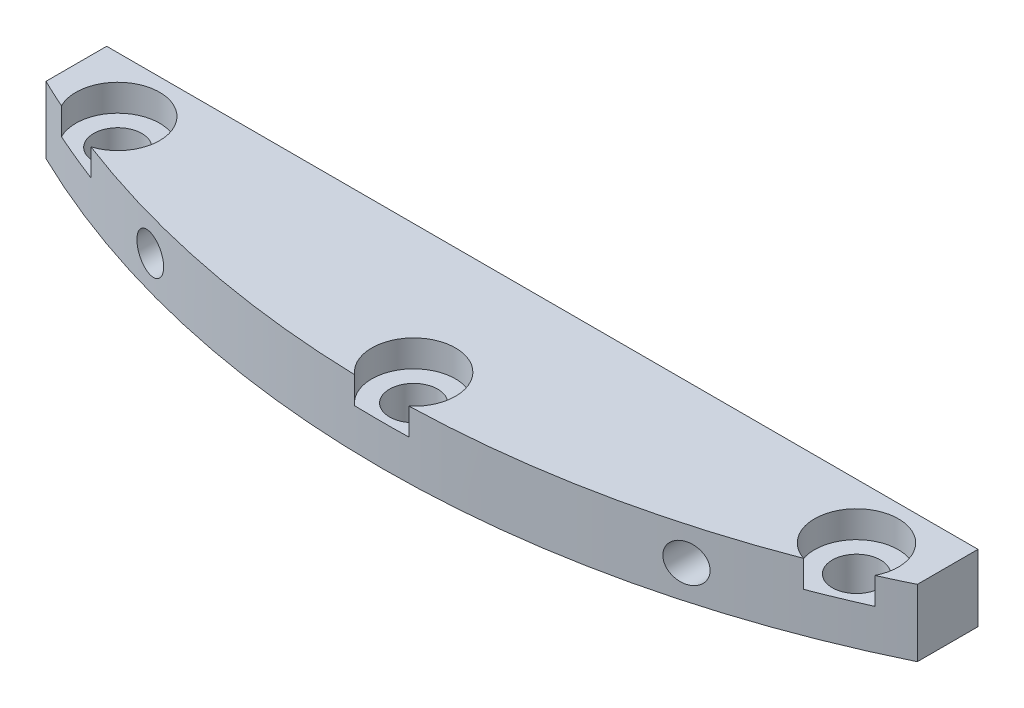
ISO-10303-21;
HEADER;
FILE_DESCRIPTION(('STEP AP214'),'2;1');
FILE_NAME('part.step','',(''),(''),'','','');
FILE_SCHEMA(('AUTOMOTIVE_DESIGN { 1 0 10303 214 1 1 1 1 }'));
ENDSEC;
DATA;
#1=APPLICATION_CONTEXT('core data for automotive mechanical design processes');
#2=APPLICATION_PROTOCOL_DEFINITION('international standard','automotive_design',2000,#1);
#3=PRODUCT_CONTEXT('',#1,'mechanical');
#4=PRODUCT('Part','Part','',(#3));
#5=PRODUCT_RELATED_PRODUCT_CATEGORY('part','',(#4));
#6=PRODUCT_DEFINITION_FORMATION('','',#4);
#7=PRODUCT_DEFINITION_CONTEXT('part definition',#1,'design');
#8=PRODUCT_DEFINITION('design','',#6,#7);
#9=PRODUCT_DEFINITION_SHAPE('','',#8);
#10=(LENGTH_UNIT() NAMED_UNIT(*) SI_UNIT(.MILLI.,.METRE.));
#11=(NAMED_UNIT(*) PLANE_ANGLE_UNIT() SI_UNIT($,.RADIAN.));
#12=(NAMED_UNIT(*) SI_UNIT($,.STERADIAN.) SOLID_ANGLE_UNIT());
#13=UNCERTAINTY_MEASURE_WITH_UNIT(LENGTH_MEASURE(1.E-05),#10,'distance_accuracy_value','');
#14=(GEOMETRIC_REPRESENTATION_CONTEXT(3) GLOBAL_UNCERTAINTY_ASSIGNED_CONTEXT((#13)) GLOBAL_UNIT_ASSIGNED_CONTEXT((#10,
#11,#12)) REPRESENTATION_CONTEXT('',''));
#15=CARTESIAN_POINT('',(0.,0.,0.));
#16=DIRECTION('',(0.,0.,1.));
#17=DIRECTION('',(1.,0.,0.));
#18=AXIS2_PLACEMENT_3D('',#15,#16,#17);
#19=CARTESIAN_POINT('',(-34.9925730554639,6.35,84.479544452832));
#20=DIRECTION('',(0.,-1.,0.));
#21=DIRECTION('',(0.,0.,-1.));
#22=AXIS2_PLACEMENT_3D('',#19,#20,#21);
#23=CYLINDRICAL_SURFACE('',#22,2.286);
#24=CARTESIAN_POINT('',(-34.9925730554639,0.,84.479544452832));
#25=DIRECTION('',(0.,1.,0.));
#26=DIRECTION('',(0.,0.,1.));
#27=AXIS2_PLACEMENT_3D('',#24,#25,#26);
#28=CIRCLE('',#27,2.286);
#29=CARTESIAN_POINT('',(-34.9925730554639,0.,86.765544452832));
#30=VERTEX_POINT('',#29);
#31=EDGE_CURVE('E282',#30,#30,#28,.T.);
#32=ORIENTED_EDGE('',*,*,#31,.F.);
#33=EDGE_LOOP('',(#32));
#34=FACE_BOUND('',#33,.T.);
#35=CARTESIAN_POINT('',(-34.9925730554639,3.81,84.479544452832));
#36=DIRECTION('',(0.,1.,0.));
#37=DIRECTION('',(0.,0.,1.));
#38=AXIS2_PLACEMENT_3D('',#35,#36,#37);
#39=CIRCLE('',#38,2.286);
#40=CARTESIAN_POINT('',(-34.9925730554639,3.81,86.765544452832));
#41=VERTEX_POINT('',#40);
#42=EDGE_CURVE('E307',#41,#41,#39,.T.);
#43=ORIENTED_EDGE('',*,*,#42,.T.);
#44=EDGE_LOOP('',(#43));
#45=FACE_BOUND('',#44,.T.);
#46=ADVANCED_FACE('F89',(#34,#45),#23,.F.);
#47=CARTESIAN_POINT('',(0.,6.35,91.440000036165));
#48=DIRECTION('',(0.,-1.,0.));
#49=DIRECTION('',(0.,0.,-1.));
#50=AXIS2_PLACEMENT_3D('',#47,#48,#49);
#51=CYLINDRICAL_SURFACE('',#50,2.286);
#52=CARTESIAN_POINT('',(0.,0.,91.440000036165));
#53=DIRECTION('',(0.,1.,0.));
#54=DIRECTION('',(0.,0.,1.));
#55=AXIS2_PLACEMENT_3D('',#52,#53,#54);
#56=CIRCLE('',#55,2.286);
#57=CARTESIAN_POINT('',(0.,0.,93.726000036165));
#58=VERTEX_POINT('',#57);
#59=EDGE_CURVE('E224',#58,#58,#56,.T.);
#60=ORIENTED_EDGE('',*,*,#59,.F.);
#61=EDGE_LOOP('',(#60));
#62=FACE_BOUND('',#61,.T.);
#63=CARTESIAN_POINT('',(0.,3.81,91.440000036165));
#64=DIRECTION('',(0.,1.,0.));
#65=DIRECTION('',(0.,0.,1.));
#66=AXIS2_PLACEMENT_3D('',#63,#64,#65);
#67=CIRCLE('',#66,2.286);
#68=CARTESIAN_POINT('',(0.,3.81,93.726000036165));
#69=VERTEX_POINT('',#68);
#70=EDGE_CURVE('E302',#69,#69,#67,.T.);
#71=ORIENTED_EDGE('',*,*,#70,.T.);
#72=EDGE_LOOP('',(#71));
#73=FACE_BOUND('',#72,.T.);
#74=ADVANCED_FACE('F242',(#62,#73),#51,.F.);
#75=CARTESIAN_POINT('',(34.9925730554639,6.35,84.479544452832));
#76=DIRECTION('',(0.,-1.,0.));
#77=DIRECTION('',(0.,0.,-1.));
#78=AXIS2_PLACEMENT_3D('',#75,#76,#77);
#79=CYLINDRICAL_SURFACE('',#78,2.286);
#80=CARTESIAN_POINT('',(34.9925730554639,0.,84.479544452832));
#81=DIRECTION('',(0.,1.,0.));
#82=DIRECTION('',(0.,0.,-1.));
#83=AXIS2_PLACEMENT_3D('',#80,#81,#82);
#84=CIRCLE('',#83,2.286);
#85=CARTESIAN_POINT('',(34.9925730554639,0.,82.193544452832));
#86=VERTEX_POINT('',#85);
#87=EDGE_CURVE('E198',#86,#86,#84,.T.);
#88=ORIENTED_EDGE('',*,*,#87,.F.);
#89=EDGE_LOOP('',(#88));
#90=FACE_BOUND('',#89,.T.);
#91=CARTESIAN_POINT('',(34.9925730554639,3.81,84.479544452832));
#92=DIRECTION('',(0.,1.,0.));
#93=DIRECTION('',(0.,0.,1.));
#94=AXIS2_PLACEMENT_3D('',#91,#92,#93);
#95=CIRCLE('',#94,2.286);
#96=CARTESIAN_POINT('',(34.9925730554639,3.81,86.765544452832));
#97=VERTEX_POINT('',#96);
#98=EDGE_CURVE('E294',#97,#97,#95,.T.);
#99=ORIENTED_EDGE('',*,*,#98,.T.);
#100=EDGE_LOOP('',(#99));
#101=FACE_BOUND('',#100,.T.);
#102=ADVANCED_FACE('F245',(#90,#101),#79,.F.);
#103=CARTESIAN_POINT('',(0.,6.35,0.));
#104=DIRECTION('',(0.,1.,0.));
#105=DIRECTION('',(0.,0.,1.));
#106=AXIS2_PLACEMENT_3D('',#103,#104,#105);
#107=PLANE('',#106);
#108=CARTESIAN_POINT('',(-34.9925730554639,6.35,84.479544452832));
#109=DIRECTION('',(0.,1.,0.));
#110=DIRECTION('',(0.,0.,1.));
#111=AXIS2_PLACEMENT_3D('',#108,#109,#110);
#112=CIRCLE('',#111,3.96875);
#113=CARTESIAN_POINT('',(-33.7585751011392,6.35,88.2515764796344));
#114=VERTEX_POINT('',#113);
#115=CARTESIAN_POINT('',(-38.532370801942,6.35,86.2742055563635));
#116=VERTEX_POINT('',#115);
#117=EDGE_CURVE('E167',#114,#116,#112,.T.);
#118=ORIENTED_EDGE('',*,*,#117,.F.);
#119=CARTESIAN_POINT('',(0.,6.35,0.));
#120=DIRECTION('',(0.,1.,0.));
#121=DIRECTION('',(0.,0.,1.));
#122=AXIS2_PLACEMENT_3D('',#119,#120,#121);
#123=CIRCLE('',#122,94.488);
#124=CARTESIAN_POINT('',(-2.5835596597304,6.35,94.4526726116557));
#125=VERTEX_POINT('',#124);
#126=EDGE_CURVE('E176',#114,#125,#123,.T.);
#127=ORIENTED_EDGE('',*,*,#126,.T.);
#128=CARTESIAN_POINT('',(0.,6.35,91.440000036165));
#129=DIRECTION('',(0.,1.,0.));
#130=DIRECTION('',(0.,0.,1.));
#131=AXIS2_PLACEMENT_3D('',#128,#129,#130);
#132=CIRCLE('',#131,3.96875);
#133=CARTESIAN_POINT('',(2.58355965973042,6.35,94.4526726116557));
#134=VERTEX_POINT('',#133);
#135=EDGE_CURVE('E303',#134,#125,#132,.T.);
#136=ORIENTED_EDGE('',*,*,#135,.F.);
#137=CARTESIAN_POINT('',(33.7585751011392,6.35,88.2515764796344));
#138=VERTEX_POINT('',#137);
#139=EDGE_CURVE('E184',#134,#138,#123,.T.);
#140=ORIENTED_EDGE('',*,*,#139,.T.);
#141=CARTESIAN_POINT('',(34.9925730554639,6.35,84.479544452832));
#142=DIRECTION('',(0.,1.,0.));
#143=DIRECTION('',(0.,0.,1.));
#144=AXIS2_PLACEMENT_3D('',#141,#142,#143);
#145=CIRCLE('',#144,3.96875);
#146=CARTESIAN_POINT('',(38.532370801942,6.35,86.2742055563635));
#147=VERTEX_POINT('',#146);
#148=EDGE_CURVE('E295',#147,#138,#145,.T.);
#149=ORIENTED_EDGE('',*,*,#148,.F.);
#150=CARTESIAN_POINT('',(41.275,6.35,84.9962147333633));
#151=VERTEX_POINT('',#150);
#152=EDGE_CURVE('E187',#147,#151,#123,.T.);
#153=ORIENTED_EDGE('',*,*,#152,.T.);
#154=DIRECTION('',(0.,0.,-1.));
#155=VECTOR('',#154,1.);
#156=CARTESIAN_POINT('',(41.275,6.35,79.248000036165));
#157=LINE('',#156,#155);
#158=CARTESIAN_POINT('',(41.275,6.35,79.248000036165));
#159=VERTEX_POINT('',#158);
#160=EDGE_CURVE('E186',#151,#159,#157,.T.);
#161=ORIENTED_EDGE('',*,*,#160,.T.);
#162=DIRECTION('',(-1.,0.,0.));
#163=VECTOR('',#162,1.);
#164=CARTESIAN_POINT('',(41.275,6.35,79.248000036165));
#165=LINE('',#164,#163);
#166=CARTESIAN_POINT('',(-41.275,6.35,79.248000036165));
#167=VERTEX_POINT('',#166);
#168=EDGE_CURVE('E204',#159,#167,#165,.T.);
#169=ORIENTED_EDGE('',*,*,#168,.T.);
#170=DIRECTION('',(0.,0.,1.));
#171=VECTOR('',#170,1.);
#172=CARTESIAN_POINT('',(-41.275,6.35,79.248000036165));
#173=LINE('',#172,#171);
#174=CARTESIAN_POINT('',(-41.275,6.35,84.9962147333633));
#175=VERTEX_POINT('',#174);
#176=EDGE_CURVE('E190',#167,#175,#173,.T.);
#177=ORIENTED_EDGE('',*,*,#176,.T.);
#178=EDGE_CURVE('E179',#175,#116,#123,.T.);
#179=ORIENTED_EDGE('',*,*,#178,.T.);
#180=EDGE_LOOP('',(#118,#127,#136,#140,#149,#153,#161,#169,#177,#179));
#181=FACE_BOUND('',#180,.T.);
#182=ADVANCED_FACE('F174',(#181),#107,.T.);
#183=CARTESIAN_POINT('',(0.,0.,0.));
#184=DIRECTION('',(0.,1.,0.));
#185=DIRECTION('',(0.,0.,1.));
#186=AXIS2_PLACEMENT_3D('',#183,#184,#185);
#187=PLANE('',#186);
#188=ORIENTED_EDGE('',*,*,#31,.T.);
#189=EDGE_LOOP('',(#188));
#190=FACE_BOUND('',#189,.T.);
#191=DIRECTION('',(-1.,0.,0.));
#192=VECTOR('',#191,1.);
#193=CARTESIAN_POINT('',(41.275,0.,79.248000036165));
#194=LINE('',#193,#192);
#195=CARTESIAN_POINT('',(41.275,0.,79.248000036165));
#196=VERTEX_POINT('',#195);
#197=CARTESIAN_POINT('',(-41.275,0.,79.248000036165));
#198=VERTEX_POINT('',#197);
#199=EDGE_CURVE('E194',#196,#198,#194,.T.);
#200=ORIENTED_EDGE('',*,*,#199,.F.);
#201=DIRECTION('',(0.,0.,-1.));
#202=VECTOR('',#201,1.);
#203=CARTESIAN_POINT('',(41.275,0.,79.248000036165));
#204=LINE('',#203,#202);
#205=CARTESIAN_POINT('',(41.275,0.,84.9962147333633));
#206=VERTEX_POINT('',#205);
#207=EDGE_CURVE('E202',#206,#196,#204,.T.);
#208=ORIENTED_EDGE('',*,*,#207,.F.);
#209=CARTESIAN_POINT('',(0.,0.,0.));
#210=DIRECTION('',(0.,1.,0.));
#211=DIRECTION('',(0.,0.,1.));
#212=AXIS2_PLACEMENT_3D('',#209,#210,#211);
#213=CIRCLE('',#212,94.488);
#214=CARTESIAN_POINT('',(-41.275,0.,84.9962147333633));
#215=VERTEX_POINT('',#214);
#216=EDGE_CURVE('E200',#215,#206,#213,.T.);
#217=ORIENTED_EDGE('',*,*,#216,.F.);
#218=DIRECTION('',(0.,0.,1.));
#219=VECTOR('',#218,1.);
#220=CARTESIAN_POINT('',(-41.275,0.,79.248000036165));
#221=LINE('',#220,#219);
#222=EDGE_CURVE('E197',#198,#215,#221,.T.);
#223=ORIENTED_EDGE('',*,*,#222,.F.);
#224=EDGE_LOOP('',(#200,#208,#217,#223));
#225=FACE_BOUND('',#224,.T.);
#226=ORIENTED_EDGE('',*,*,#87,.T.);
#227=EDGE_LOOP('',(#226));
#228=FACE_BOUND('',#227,.T.);
#229=ORIENTED_EDGE('',*,*,#59,.T.);
#230=EDGE_LOOP('',(#229));
#231=FACE_BOUND('',#230,.T.);
#232=ADVANCED_FACE('F255',(#190,#225,#228,#231),#187,.F.);
#233=CARTESIAN_POINT('',(41.275,6.35,79.248000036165));
#234=DIRECTION('',(0.,0.,1.));
#235=DIRECTION('',(1.,0.,0.));
#236=AXIS2_PLACEMENT_3D('',#233,#234,#235);
#237=PLANE('',#236);
#238=CARTESIAN_POINT('',(-25.4,3.175,79.248000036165));
#239=DIRECTION('',(0.,0.,-1.));
#240=DIRECTION('',(1.,0.,0.));
#241=AXIS2_PLACEMENT_3D('',#238,#239,#240);
#242=CIRCLE('',#241,1.7526);
#243=CARTESIAN_POINT('',(-23.6474,3.175,79.248000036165));
#244=VERTEX_POINT('',#243);
#245=EDGE_CURVE('E289',#244,#244,#242,.T.);
#246=ORIENTED_EDGE('',*,*,#245,.F.);
#247=EDGE_LOOP('',(#246));
#248=FACE_BOUND('',#247,.T.);
#249=CARTESIAN_POINT('',(25.4,3.175,79.248000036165));
#250=DIRECTION('',(0.,0.,-1.));
#251=DIRECTION('',(-1.,0.,0.));
#252=AXIS2_PLACEMENT_3D('',#249,#250,#251);
#253=CIRCLE('',#252,1.7526);
#254=CARTESIAN_POINT('',(23.6474,3.175,79.248000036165));
#255=VERTEX_POINT('',#254);
#256=EDGE_CURVE('E225',#255,#255,#253,.T.);
#257=ORIENTED_EDGE('',*,*,#256,.F.);
#258=EDGE_LOOP('',(#257));
#259=FACE_BOUND('',#258,.T.);
#260=ORIENTED_EDGE('',*,*,#199,.T.);
#261=DIRECTION('',(0.,-1.,0.));
#262=VECTOR('',#261,1.);
#263=CARTESIAN_POINT('',(-41.275,6.35,79.248000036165));
#264=LINE('',#263,#262);
#265=EDGE_CURVE('E213',#167,#198,#264,.T.);
#266=ORIENTED_EDGE('',*,*,#265,.F.);
#267=ORIENTED_EDGE('',*,*,#168,.F.);
#268=DIRECTION('',(0.,-1.,0.));
#269=VECTOR('',#268,1.);
#270=CARTESIAN_POINT('',(41.275,6.35,79.248000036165));
#271=LINE('',#270,#269);
#272=EDGE_CURVE('E193',#159,#196,#271,.T.);
#273=ORIENTED_EDGE('',*,*,#272,.T.);
#274=EDGE_LOOP('',(#260,#266,#267,#273));
#275=FACE_BOUND('',#274,.T.);
#276=ADVANCED_FACE('F91',(#248,#259,#275),#237,.F.);
#277=CARTESIAN_POINT('',(-41.275,6.35,79.248000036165));
#278=DIRECTION('',(1.,0.,0.));
#279=DIRECTION('',(0.,0.,-1.));
#280=AXIS2_PLACEMENT_3D('',#277,#278,#279);
#281=PLANE('',#280);
#282=ORIENTED_EDGE('',*,*,#222,.T.);
#283=DIRECTION('',(0.,-1.,0.));
#284=VECTOR('',#283,1.);
#285=CARTESIAN_POINT('',(-41.275,6.35,84.9962147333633));
#286=LINE('',#285,#284);
#287=EDGE_CURVE('E210',#175,#215,#286,.T.);
#288=ORIENTED_EDGE('',*,*,#287,.F.);
#289=ORIENTED_EDGE('',*,*,#176,.F.);
#290=ORIENTED_EDGE('',*,*,#265,.T.);
#291=EDGE_LOOP('',(#282,#288,#289,#290));
#292=FACE_BOUND('',#291,.T.);
#293=ADVANCED_FACE('F263',(#292),#281,.F.);
#294=CARTESIAN_POINT('',(0.,6.35,0.));
#295=DIRECTION('',(0.,-1.,0.));
#296=DIRECTION('',(0.,0.,-1.));
#297=AXIS2_PLACEMENT_3D('',#294,#295,#296);
#298=CYLINDRICAL_SURFACE('',#297,94.488);
#299=CARTESIAN_POINT('',(-27.1526,3.175,90.5025881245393));
#300=CARTESIAN_POINT('',(-27.1525952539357,3.27043165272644,90.5025896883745));
#301=CARTESIAN_POINT('',(-27.1447734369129,3.36593551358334,90.5049373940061));
#302=CARTESIAN_POINT('',(-27.1137393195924,3.55425445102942,90.5142394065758));
#303=CARTESIAN_POINT('',(-27.0905079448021,3.64706604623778,90.5211994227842));
#304=CARTESIAN_POINT('',(-27.0295060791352,3.82718212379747,90.5394331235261));
#305=CARTESIAN_POINT('',(-26.9917561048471,3.91449417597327,90.5507007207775));
#306=CARTESIAN_POINT('',(-26.9029874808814,4.08140654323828,90.5771137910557));
#307=CARTESIAN_POINT('',(-26.8519710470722,4.16100814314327,90.5922586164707));
#308=CARTESIAN_POINT('',(-26.7371804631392,4.31197655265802,90.6262046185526));
#309=CARTESIAN_POINT('',(-26.6731836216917,4.3831595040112,90.6450694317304));
#310=CARTESIAN_POINT('',(-26.5349739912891,4.51383950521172,90.6856244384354));
#311=CARTESIAN_POINT('',(-26.4607591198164,4.57333416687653,90.7073152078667));
#312=CARTESIAN_POINT('',(-26.3010670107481,4.68143417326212,90.7537502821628));
#313=CARTESIAN_POINT('',(-26.2152604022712,4.72951569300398,90.7785814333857));
#314=CARTESIAN_POINT('',(-26.0372225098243,4.81058155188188,90.8298066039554));
#315=CARTESIAN_POINT('',(-25.9449899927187,4.84356298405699,90.8562009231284));
#316=CARTESIAN_POINT('',(-25.7532814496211,4.89458498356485,90.9107303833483));
#317=CARTESIAN_POINT('',(-25.6536652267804,4.91206934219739,90.9388941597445));
#318=CARTESIAN_POINT('',(-25.4529216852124,4.92969690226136,90.9952844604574));
#319=CARTESIAN_POINT('',(-25.3517941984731,4.92983816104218,91.0235109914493));
#320=CARTESIAN_POINT('',(-25.1493305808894,4.91259691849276,91.0796602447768));
#321=CARTESIAN_POINT('',(-25.0480132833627,4.89495648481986,91.1075723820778));
#322=CARTESIAN_POINT('',(-24.8496342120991,4.84210522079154,91.1618802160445));
#323=CARTESIAN_POINT('',(-24.7525723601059,4.80689471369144,91.1882759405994));
#324=CARTESIAN_POINT('',(-24.566613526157,4.7201507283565,91.2385490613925));
#325=CARTESIAN_POINT('',(-24.4776426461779,4.66878938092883,91.2624496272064));
#326=CARTESIAN_POINT('',(-24.3095621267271,4.55089394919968,91.3073650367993));
#327=CARTESIAN_POINT('',(-24.2304510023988,4.48436215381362,91.3283803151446));
#328=CARTESIAN_POINT('',(-24.0868478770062,4.34003292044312,91.3663574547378));
#329=CARTESIAN_POINT('',(-24.0219997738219,4.26261615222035,91.383418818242));
#330=CARTESIAN_POINT('',(-23.9062940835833,4.09729202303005,91.4137562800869));
#331=CARTESIAN_POINT('',(-23.8554336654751,4.00938679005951,91.4270331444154));
#332=CARTESIAN_POINT('',(-23.7709526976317,3.82877145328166,91.44903390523));
#333=CARTESIAN_POINT('',(-23.7368100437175,3.73632223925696,91.4578958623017));
#334=CARTESIAN_POINT('',(-23.6844560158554,3.54672867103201,91.4714678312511));
#335=CARTESIAN_POINT('',(-23.6662420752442,3.44958507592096,91.476178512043));
#336=CARTESIAN_POINT('',(-23.6466315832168,3.25591826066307,91.4812497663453));
#337=CARTESIAN_POINT('',(-23.6448338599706,3.15943817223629,91.4817141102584));
#338=CARTESIAN_POINT('',(-23.6570670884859,2.96755943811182,91.4785513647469));
#339=CARTESIAN_POINT('',(-23.6710969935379,2.87216072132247,91.4749245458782));
#340=CARTESIAN_POINT('',(-23.714356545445,2.68581660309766,91.4637191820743));
#341=CARTESIAN_POINT('',(-23.7434813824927,2.59484516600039,91.456167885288));
#342=CARTESIAN_POINT('',(-23.8159116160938,2.41915584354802,91.4373331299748));
#343=CARTESIAN_POINT('',(-23.8592175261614,2.33443818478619,91.4260495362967));
#344=CARTESIAN_POINT('',(-23.9592606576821,2.17247850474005,91.3998833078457));
#345=CARTESIAN_POINT('',(-24.0161584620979,2.09534274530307,91.3849575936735));
#346=CARTESIAN_POINT('',(-24.1413286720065,1.9517128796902,91.3519708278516));
#347=CARTESIAN_POINT('',(-24.2096024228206,1.88522003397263,91.3339094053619));
#348=CARTESIAN_POINT('',(-24.3575308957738,1.76279179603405,91.294571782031));
#349=CARTESIAN_POINT('',(-24.4374457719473,1.70719480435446,91.2732211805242));
#350=CARTESIAN_POINT('',(-24.6048619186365,1.6101586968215,91.2282326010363));
#351=CARTESIAN_POINT('',(-24.6923644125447,1.56872186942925,91.2045942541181));
#352=CARTESIAN_POINT('',(-24.8755436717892,1.49975614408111,91.1548065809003));
#353=CARTESIAN_POINT('',(-24.971394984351,1.47273193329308,91.12860010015));
#354=CARTESIAN_POINT('',(-25.1659810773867,1.43526914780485,91.0750554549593));
#355=CARTESIAN_POINT('',(-25.2647163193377,1.42483324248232,91.0477171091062));
#356=CARTESIAN_POINT('',(-25.4650339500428,1.42066983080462,90.9918967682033));
#357=CARTESIAN_POINT('',(-25.5666227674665,1.42739012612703,90.9634036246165));
#358=CARTESIAN_POINT('',(-25.7672208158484,1.45830069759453,90.9067838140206));
#359=CARTESIAN_POINT('',(-25.8662298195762,1.48249250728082,90.8786571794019));
#360=CARTESIAN_POINT('',(-26.0595833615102,1.54802375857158,90.8234025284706));
#361=CARTESIAN_POINT('',(-26.1538882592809,1.5894879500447,90.7962833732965));
#362=CARTESIAN_POINT('',(-26.3342258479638,1.68859118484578,90.7441431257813));
#363=CARTESIAN_POINT('',(-26.4202593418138,1.74622865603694,90.7191218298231));
#364=CARTESIAN_POINT('',(-26.5798480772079,1.87504307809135,90.6724909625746));
#365=CARTESIAN_POINT('',(-26.6536030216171,1.9459526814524,90.650827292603));
#366=CARTESIAN_POINT('',(-26.7880727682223,2.10014279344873,90.6111815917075));
#367=CARTESIAN_POINT('',(-26.8487870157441,2.18342382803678,90.5931997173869));
#368=CARTESIAN_POINT('',(-26.9529812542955,2.35665117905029,90.562253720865));
#369=CARTESIAN_POINT('',(-26.9970195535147,2.44623307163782,90.5491274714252));
#370=CARTESIAN_POINT('',(-27.0693223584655,2.63198171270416,90.5275392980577));
#371=CARTESIAN_POINT('',(-27.0976116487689,2.72813784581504,90.5190700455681));
#372=CARTESIAN_POINT('',(-27.1291628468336,2.88338906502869,90.509617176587));
#373=CARTESIAN_POINT('',(-27.1379383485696,2.94132171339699,90.5069858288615));
#374=CARTESIAN_POINT('',(-27.1496583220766,3.05782717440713,90.5034708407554));
#375=CARTESIAN_POINT('',(-27.1526029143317,3.11639997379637,90.5025871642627));
#376=CARTESIAN_POINT('',(-27.1526,3.175,90.5025881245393));
#377=B_SPLINE_CURVE_WITH_KNOTS('',3,(#299,#300,#301,#302,#303,#304,#305,#306,#307,#308,#309,
#310,#311,#312,#313,#314,#315,#316,#317,#318,#319,#320,#321,#322,#323,#324,#325,#326,#327,#328,
#329,#330,#331,#332,#333,#334,#335,#336,#337,#338,#339,#340,#341,#342,#343,#344,#345,#346,#347,
#348,#349,#350,#351,#352,#353,#354,#355,#356,#357,#358,#359,#360,#361,#362,#363,#364,#365,#366,
#367,#368,#369,#370,#371,#372,#373,#374,#375,#376),.UNSPECIFIED.,.T.,.F.,(4,2,2,2,2,2,2,2,2,2,2,
2,2,2,2,2,2,2,2,2,2,2,2,2,2,2,2,2,2,2,2,2,2,2,2,2,2,2,4),(0.,0.286075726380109,
0.572506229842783,0.858533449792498,1.14451292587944,1.4358919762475,1.72733050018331,
2.03029711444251,2.33332202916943,2.64682757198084,2.96036823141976,3.27852335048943,
3.59667261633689,3.91153993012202,4.22635976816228,4.53209121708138,4.83776074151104,
5.13315393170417,5.42849951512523,5.71660767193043,6.00469677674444,6.29081184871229,
6.5769372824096,6.86662673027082,7.15635046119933,7.45399642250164,7.75169046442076,
8.0592191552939,8.36679732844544,8.68248534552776,8.99820107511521,9.31623772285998,
9.63424346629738,9.94642416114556,10.2586181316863,10.5591687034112,10.8592449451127,
11.0349140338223,11.2105794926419),.UNSPECIFIED.);
#378=CARTESIAN_POINT('',(-27.1526,3.175,90.5025881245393));
#379=VERTEX_POINT('',#378);
#380=EDGE_CURVE('E226',#379,#379,#377,.T.);
#381=ORIENTED_EDGE('',*,*,#380,.T.);
#382=EDGE_LOOP('',(#381));
#383=FACE_BOUND('',#382,.T.);
#384=CARTESIAN_POINT('',(23.6474,3.175,91.4810505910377));
#385=CARTESIAN_POINT('',(23.6474046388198,3.27107703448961,91.4810495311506));
#386=CARTESIAN_POINT('',(23.6553312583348,3.36722610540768,91.4790015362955));
#387=CARTESIAN_POINT('',(23.686796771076,3.55683705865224,91.4708590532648));
#388=CARTESIAN_POINT('',(23.7103548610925,3.65029548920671,91.4647595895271));
#389=CARTESIAN_POINT('',(23.7722669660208,3.83170677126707,91.4486877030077));
#390=CARTESIAN_POINT('',(23.8106044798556,3.91966563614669,91.4387195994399));
#391=CARTESIAN_POINT('',(23.9008167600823,4.0877746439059,91.4151807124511));
#392=CARTESIAN_POINT('',(23.9526888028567,4.16792635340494,91.4016106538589));
#393=CARTESIAN_POINT('',(24.0691237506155,4.31938576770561,91.3710188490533));
#394=CARTESIAN_POINT('',(24.1338449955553,4.39056290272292,91.3539539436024));
#395=CARTESIAN_POINT('',(24.2735755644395,4.52107537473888,91.3169255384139));
#396=CARTESIAN_POINT('',(24.348586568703,4.58040877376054,91.296961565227));
#397=CARTESIAN_POINT('',(24.5091612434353,4.68748288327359,91.2539876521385));
#398=CARTESIAN_POINT('',(24.5949761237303,4.73481702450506,91.2309036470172));
#399=CARTESIAN_POINT('',(24.7728115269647,4.81443207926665,91.1827748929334));
#400=CARTESIAN_POINT('',(24.864833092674,4.8467104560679,91.1577298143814));
#401=CARTESIAN_POINT('',(25.0556391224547,4.89635123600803,91.105472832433));
#402=CARTESIAN_POINT('',(25.1545460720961,4.91319714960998,91.0782170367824));
#403=CARTESIAN_POINT('',(25.3535954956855,4.92983100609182,91.0230081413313));
#404=CARTESIAN_POINT('',(25.4537381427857,4.92961653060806,90.9950549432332));
#405=CARTESIAN_POINT('',(25.6547039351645,4.91198698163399,90.9386025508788));
#406=CARTESIAN_POINT('',(25.755495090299,4.89420063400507,90.910104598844));
#407=CARTESIAN_POINT('',(25.9526955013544,4.84130034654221,90.854005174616));
#408=CARTESIAN_POINT('',(26.0491045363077,4.80618553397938,90.8264037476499));
#409=CARTESIAN_POINT('',(26.2346893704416,4.71946915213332,90.7729725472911));
#410=CARTESIAN_POINT('',(26.3238684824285,4.66787518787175,90.7471419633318));
#411=CARTESIAN_POINT('',(26.4922911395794,4.5494454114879,90.6981166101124));
#412=CARTESIAN_POINT('',(26.5715358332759,4.48261136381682,90.6749215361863));
#413=CARTESIAN_POINT('',(26.7155861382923,4.33733972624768,90.6325830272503));
#414=CARTESIAN_POINT('',(26.7807104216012,4.25924438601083,90.6133508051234));
#415=CARTESIAN_POINT('',(26.8967936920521,4.09235425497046,90.5789617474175));
#416=CARTESIAN_POINT('',(26.9477562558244,4.00356217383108,90.5638038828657));
#417=CARTESIAN_POINT('',(27.0318904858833,3.82166342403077,90.5387259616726));
#418=CARTESIAN_POINT('',(27.0656990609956,3.72887711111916,90.5286186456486));
#419=CARTESIAN_POINT('',(27.1173032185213,3.53857731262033,90.5131744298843));
#420=CARTESIAN_POINT('',(27.1351025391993,3.44106493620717,90.507836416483));
#421=CARTESIAN_POINT('',(27.1536916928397,3.24768741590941,90.5022610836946));
#422=CARTESIAN_POINT('',(27.1550454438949,3.15188095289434,90.5018546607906));
#423=CARTESIAN_POINT('',(27.1421539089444,2.96142572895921,90.5057217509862));
#424=CARTESIAN_POINT('',(27.1279100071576,2.86677686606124,90.5099948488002));
#425=CARTESIAN_POINT('',(27.0845546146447,2.68227800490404,90.5229779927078));
#426=CARTESIAN_POINT('',(27.055592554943,2.59238961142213,90.5316434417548));
#427=CARTESIAN_POINT('',(26.9838657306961,2.41882845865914,90.5530481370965));
#428=CARTESIAN_POINT('',(26.9411000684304,2.33515610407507,90.5657876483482));
#429=CARTESIAN_POINT('',(26.8422104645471,2.17465684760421,90.5951465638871));
#430=CARTESIAN_POINT('',(26.7858511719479,2.09798764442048,90.6118342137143));
#431=CARTESIAN_POINT('',(26.6619576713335,1.95515899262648,90.6483663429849));
#432=CARTESIAN_POINT('',(26.5944215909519,1.88900130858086,90.6682113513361));
#433=CARTESIAN_POINT('',(26.4474052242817,1.76643904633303,90.7112064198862));
#434=CARTESIAN_POINT('',(26.3675739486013,1.71048909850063,90.7344519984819));
#435=CARTESIAN_POINT('',(26.2002198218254,1.61274162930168,90.782918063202));
#436=CARTESIAN_POINT('',(26.11269547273,1.57094687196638,90.808138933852));
#437=CARTESIAN_POINT('',(25.9288569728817,1.50109830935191,90.8608055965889));
#438=CARTESIAN_POINT('',(25.8323352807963,1.47362633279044,90.8882995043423));
#439=CARTESIAN_POINT('',(25.6361694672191,1.43551208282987,90.9438252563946));
#440=CARTESIAN_POINT('',(25.5365248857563,1.42487230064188,90.9718571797));
#441=CARTESIAN_POINT('',(25.3346179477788,1.42064907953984,91.0282950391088));
#442=CARTESIAN_POINT('',(25.2323459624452,1.4274433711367,91.0566957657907));
#443=CARTESIAN_POINT('',(25.0302606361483,1.4587963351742,91.1124535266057));
#444=CARTESIAN_POINT('',(24.9304473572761,1.48335545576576,91.1398105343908));
#445=CARTESIAN_POINT('',(24.7364885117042,1.54962889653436,91.1926442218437));
#446=CARTESIAN_POINT('',(24.6423275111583,1.59129381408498,91.2181260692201));
#447=CARTESIAN_POINT('',(24.4622658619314,1.69080406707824,91.2665787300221));
#448=CARTESIAN_POINT('',(24.3763639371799,1.74864689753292,91.2895499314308));
#449=CARTESIAN_POINT('',(24.2175976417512,1.87741699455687,91.3317945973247));
#450=CARTESIAN_POINT('',(24.144464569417,1.94798744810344,91.3511451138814));
#451=CARTESIAN_POINT('',(24.0111292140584,2.10124250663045,91.3862822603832));
#452=CARTESIAN_POINT('',(23.9509277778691,2.18392790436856,91.4020686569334));
#453=CARTESIAN_POINT('',(23.8473483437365,2.356074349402,91.4291468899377));
#454=CARTESIAN_POINT('',(23.803477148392,2.44521833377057,91.4405708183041));
#455=CARTESIAN_POINT('',(23.7313751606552,2.62993357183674,91.4593099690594));
#456=CARTESIAN_POINT('',(23.7031214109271,2.72549515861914,91.4666312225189));
#457=CARTESIAN_POINT('',(23.6712816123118,2.88065238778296,91.4748747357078));
#458=CARTESIAN_POINT('',(23.6623390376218,2.93912974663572,91.477187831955));
#459=CARTESIAN_POINT('',(23.6503968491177,3.05672897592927,91.4802760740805));
#460=CARTESIAN_POINT('',(23.6473971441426,3.1158508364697,91.48105124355));
#461=CARTESIAN_POINT('',(23.6474,3.175,91.4810505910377));
#462=B_SPLINE_CURVE_WITH_KNOTS('',3,(#384,#385,#386,#387,#388,#389,#390,#391,#392,#393,#394,
#395,#396,#397,#398,#399,#400,#401,#402,#403,#404,#405,#406,#407,#408,#409,#410,#411,#412,#413,
#414,#415,#416,#417,#418,#419,#420,#421,#422,#423,#424,#425,#426,#427,#428,#429,#430,#431,#432,
#433,#434,#435,#436,#437,#438,#439,#440,#441,#442,#443,#444,#445,#446,#447,#448,#449,#450,#451,
#452,#453,#454,#455,#456,#457,#458,#459,#460,#461),.UNSPECIFIED.,.T.,.F.,(4,2,2,2,2,2,2,2,2,2,2,
2,2,2,2,2,2,2,2,2,2,2,2,2,2,2,2,2,2,2,2,2,2,2,2,2,2,2,4),(0.,0.288011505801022,
0.576377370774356,0.864422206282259,1.15240912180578,1.44419387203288,1.73602632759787,
2.03671739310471,2.33745910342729,2.64793295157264,2.95845081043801,3.27567298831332,
3.59291114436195,3.91000310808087,4.22705837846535,4.53596753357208,4.84479860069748,
5.14112271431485,5.43737761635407,5.72344407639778,6.0094851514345,6.29267845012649,
6.57589017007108,6.86441013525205,7.15297848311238,7.45228674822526,7.7516534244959,
8.06238401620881,8.37316059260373,8.69072710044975,9.00830161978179,9.32496534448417,
9.6415800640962,9.95040741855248,10.2592549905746,10.5578243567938,10.8559536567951,
11.0332686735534,11.2105809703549),.UNSPECIFIED.);
#463=CARTESIAN_POINT('',(23.6474,3.175,91.4810505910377));
#464=VERTEX_POINT('',#463);
#465=EDGE_CURVE('E217',#464,#464,#462,.T.);
#466=ORIENTED_EDGE('',*,*,#465,.T.);
#467=EDGE_LOOP('',(#466));
#468=FACE_BOUND('',#467,.T.);
#469=CARTESIAN_POINT('',(0.,3.81,0.));
#470=DIRECTION('',(0.,1.,0.));
#471=DIRECTION('',(0.,0.,1.));
#472=AXIS2_PLACEMENT_3D('',#469,#470,#471);
#473=CIRCLE('',#472,94.488);
#474=CARTESIAN_POINT('',(-38.532370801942,3.81,86.2742055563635));
#475=VERTEX_POINT('',#474);
#476=CARTESIAN_POINT('',(-33.7585751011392,3.81,88.2515764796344));
#477=VERTEX_POINT('',#476);
#478=EDGE_CURVE('E305',#475,#477,#473,.T.);
#479=ORIENTED_EDGE('',*,*,#478,.F.);
#480=DIRECTION('',(0.,1.,0.));
#481=VECTOR('',#480,1.);
#482=CARTESIAN_POINT('',(-38.5323708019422,5.08,86.2742055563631));
#483=LINE('',#482,#481);
#484=EDGE_CURVE('E14',#475,#116,#483,.T.);
#485=ORIENTED_EDGE('',*,*,#484,.T.);
#486=ORIENTED_EDGE('',*,*,#178,.F.);
#487=ORIENTED_EDGE('',*,*,#287,.T.);
#488=ORIENTED_EDGE('',*,*,#216,.T.);
#489=DIRECTION('',(0.,-1.,0.));
#490=VECTOR('',#489,1.);
#491=CARTESIAN_POINT('',(41.275,6.35,84.9962147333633));
#492=LINE('',#491,#490);
#493=EDGE_CURVE('E207',#151,#206,#492,.T.);
#494=ORIENTED_EDGE('',*,*,#493,.F.);
#495=ORIENTED_EDGE('',*,*,#152,.F.);
#496=DIRECTION('',(0.,1.,0.));
#497=VECTOR('',#496,1.);
#498=CARTESIAN_POINT('',(38.5323708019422,5.08,86.2742055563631));
#499=LINE('',#498,#497);
#500=CARTESIAN_POINT('',(38.532370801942,3.81,86.2742055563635));
#501=VERTEX_POINT('',#500);
#502=EDGE_CURVE('E216',#147,#501,#499,.F.);
#503=ORIENTED_EDGE('',*,*,#502,.T.);
#504=CARTESIAN_POINT('',(0.,3.81,0.));
#505=DIRECTION('',(0.,1.,0.));
#506=DIRECTION('',(0.,0.,1.));
#507=AXIS2_PLACEMENT_3D('',#504,#505,#506);
#508=CIRCLE('',#507,94.488);
#509=CARTESIAN_POINT('',(33.7585751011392,3.81,88.2515764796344));
#510=VERTEX_POINT('',#509);
#511=EDGE_CURVE('E292',#510,#501,#508,.T.);
#512=ORIENTED_EDGE('',*,*,#511,.F.);
#513=DIRECTION('',(0.,1.,0.));
#514=VECTOR('',#513,1.);
#515=CARTESIAN_POINT('',(33.7585751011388,5.08,88.2515764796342));
#516=LINE('',#515,#514);
#517=EDGE_CURVE('E318',#510,#138,#516,.T.);
#518=ORIENTED_EDGE('',*,*,#517,.T.);
#519=ORIENTED_EDGE('',*,*,#139,.F.);
#520=DIRECTION('',(0.,1.,0.));
#521=VECTOR('',#520,1.);
#522=CARTESIAN_POINT('',(2.58355965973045,5.08,94.4526726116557));
#523=LINE('',#522,#521);
#524=CARTESIAN_POINT('',(2.58355965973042,3.81,94.4526726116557));
#525=VERTEX_POINT('',#524);
#526=EDGE_CURVE('E315',#134,#525,#523,.F.);
#527=ORIENTED_EDGE('',*,*,#526,.T.);
#528=CARTESIAN_POINT('',(0.,3.81,0.));
#529=DIRECTION('',(0.,1.,0.));
#530=DIRECTION('',(0.,0.,1.));
#531=AXIS2_PLACEMENT_3D('',#528,#529,#530);
#532=CIRCLE('',#531,94.488);
#533=CARTESIAN_POINT('',(-2.5835596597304,3.81,94.4526726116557));
#534=VERTEX_POINT('',#533);
#535=EDGE_CURVE('E299',#534,#525,#532,.T.);
#536=ORIENTED_EDGE('',*,*,#535,.F.);
#537=DIRECTION('',(0.,1.,0.));
#538=VECTOR('',#537,1.);
#539=CARTESIAN_POINT('',(-2.58355965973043,5.08,94.4526726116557));
#540=LINE('',#539,#538);
#541=EDGE_CURVE('E171',#534,#125,#540,.T.);
#542=ORIENTED_EDGE('',*,*,#541,.T.);
#543=ORIENTED_EDGE('',*,*,#126,.F.);
#544=DIRECTION('',(0.,1.,0.));
#545=VECTOR('',#544,1.);
#546=CARTESIAN_POINT('',(-33.7585751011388,5.08,88.2515764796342));
#547=LINE('',#546,#545);
#548=EDGE_CURVE('E97',#114,#477,#547,.F.);
#549=ORIENTED_EDGE('',*,*,#548,.T.);
#550=EDGE_LOOP('',(#479,#485,#486,#487,#488,#494,#495,#503,#512,#518,#519,#527,#536,#542,#543,#549));
#551=FACE_BOUND('',#550,.T.);
#552=ADVANCED_FACE('F182',(#383,#468,#551),#298,.T.);
#553=CARTESIAN_POINT('',(41.275,6.35,79.248000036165));
#554=DIRECTION('',(-1.,0.,0.));
#555=DIRECTION('',(0.,0.,1.));
#556=AXIS2_PLACEMENT_3D('',#553,#554,#555);
#557=PLANE('',#556);
#558=ORIENTED_EDGE('',*,*,#207,.T.);
#559=ORIENTED_EDGE('',*,*,#272,.F.);
#560=ORIENTED_EDGE('',*,*,#160,.F.);
#561=ORIENTED_EDGE('',*,*,#493,.T.);
#562=EDGE_LOOP('',(#558,#559,#560,#561));
#563=FACE_BOUND('',#562,.T.);
#564=ADVANCED_FACE('F238',(#563),#557,.F.);
#565=CARTESIAN_POINT('',(25.4,3.175,94.488));
#566=DIRECTION('',(0.,0.,-1.));
#567=DIRECTION('',(-1.,0.,0.));
#568=AXIS2_PLACEMENT_3D('',#565,#566,#567);
#569=CYLINDRICAL_SURFACE('',#568,1.7526);
#570=ORIENTED_EDGE('',*,*,#256,.T.);
#571=EDGE_LOOP('',(#570));
#572=FACE_BOUND('',#571,.T.);
#573=ORIENTED_EDGE('',*,*,#465,.F.);
#574=EDGE_LOOP('',(#573));
#575=FACE_BOUND('',#574,.T.);
#576=ADVANCED_FACE('F233',(#572,#575),#569,.F.);
#577=CARTESIAN_POINT('',(-25.4,3.175,94.488));
#578=DIRECTION('',(0.,0.,-1.));
#579=DIRECTION('',(-1.,0.,0.));
#580=AXIS2_PLACEMENT_3D('',#577,#578,#579);
#581=CYLINDRICAL_SURFACE('',#580,1.7526);
#582=ORIENTED_EDGE('',*,*,#245,.T.);
#583=EDGE_LOOP('',(#582));
#584=FACE_BOUND('',#583,.T.);
#585=ORIENTED_EDGE('',*,*,#380,.F.);
#586=EDGE_LOOP('',(#585));
#587=FACE_BOUND('',#586,.T.);
#588=ADVANCED_FACE('F237',(#584,#587),#581,.F.);
#589=CARTESIAN_POINT('',(34.9925730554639,3.81,84.479544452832));
#590=DIRECTION('',(0.,1.,0.));
#591=DIRECTION('',(0.,0.,1.));
#592=AXIS2_PLACEMENT_3D('',#589,#590,#591);
#593=CYLINDRICAL_SURFACE('',#592,3.96875);
#594=CARTESIAN_POINT('',(34.9925730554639,3.81,84.479544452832));
#595=DIRECTION('',(0.,1.,0.));
#596=DIRECTION('',(0.,0.,1.));
#597=AXIS2_PLACEMENT_3D('',#594,#595,#596);
#598=CIRCLE('',#597,3.96875);
#599=EDGE_CURVE('E298',#501,#510,#598,.T.);
#600=ORIENTED_EDGE('',*,*,#599,.F.);
#601=ORIENTED_EDGE('',*,*,#502,.F.);
#602=ORIENTED_EDGE('',*,*,#148,.T.);
#603=ORIENTED_EDGE('',*,*,#517,.F.);
#604=EDGE_LOOP('',(#600,#601,#602,#603));
#605=FACE_BOUND('',#604,.T.);
#606=ADVANCED_FACE('F332',(#605),#593,.F.);
#607=CARTESIAN_POINT('',(34.9925730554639,3.81,84.479544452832));
#608=DIRECTION('',(0.,1.,0.));
#609=DIRECTION('',(0.,0.,1.));
#610=AXIS2_PLACEMENT_3D('',#607,#608,#609);
#611=PLANE('',#610);
#612=ORIENTED_EDGE('',*,*,#98,.F.);
#613=EDGE_LOOP('',(#612));
#614=FACE_BOUND('',#613,.T.);
#615=ORIENTED_EDGE('',*,*,#511,.T.);
#616=ORIENTED_EDGE('',*,*,#599,.T.);
#617=EDGE_LOOP('',(#615,#616));
#618=FACE_BOUND('',#617,.T.);
#619=ADVANCED_FACE('F328',(#614,#618),#611,.T.);
#620=CARTESIAN_POINT('',(0.,3.81,91.440000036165));
#621=DIRECTION('',(0.,1.,0.));
#622=DIRECTION('',(0.,0.,1.));
#623=AXIS2_PLACEMENT_3D('',#620,#621,#622);
#624=CYLINDRICAL_SURFACE('',#623,3.96875);
#625=CARTESIAN_POINT('',(0.,3.81,91.440000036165));
#626=DIRECTION('',(0.,1.,0.));
#627=DIRECTION('',(0.,0.,1.));
#628=AXIS2_PLACEMENT_3D('',#625,#626,#627);
#629=CIRCLE('',#628,3.96875);
#630=EDGE_CURVE('E110',#525,#534,#629,.T.);
#631=ORIENTED_EDGE('',*,*,#630,.F.);
#632=ORIENTED_EDGE('',*,*,#526,.F.);
#633=ORIENTED_EDGE('',*,*,#135,.T.);
#634=ORIENTED_EDGE('',*,*,#541,.F.);
#635=EDGE_LOOP('',(#631,#632,#633,#634));
#636=FACE_BOUND('',#635,.T.);
#637=ADVANCED_FACE('F331',(#636),#624,.F.);
#638=CARTESIAN_POINT('',(0.,3.81,91.440000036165));
#639=DIRECTION('',(0.,1.,0.));
#640=DIRECTION('',(0.,0.,1.));
#641=AXIS2_PLACEMENT_3D('',#638,#639,#640);
#642=PLANE('',#641);
#643=ORIENTED_EDGE('',*,*,#70,.F.);
#644=EDGE_LOOP('',(#643));
#645=FACE_BOUND('',#644,.T.);
#646=ORIENTED_EDGE('',*,*,#535,.T.);
#647=ORIENTED_EDGE('',*,*,#630,.T.);
#648=EDGE_LOOP('',(#646,#647));
#649=FACE_BOUND('',#648,.T.);
#650=ADVANCED_FACE('F343',(#645,#649),#642,.T.);
#651=CARTESIAN_POINT('',(-34.9925730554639,3.81,84.479544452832));
#652=DIRECTION('',(0.,1.,0.));
#653=DIRECTION('',(0.,0.,1.));
#654=AXIS2_PLACEMENT_3D('',#651,#652,#653);
#655=CYLINDRICAL_SURFACE('',#654,3.96875);
#656=CARTESIAN_POINT('',(-34.9925730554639,3.81,84.479544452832));
#657=DIRECTION('',(0.,1.,0.));
#658=DIRECTION('',(0.,0.,1.));
#659=AXIS2_PLACEMENT_3D('',#656,#657,#658);
#660=CIRCLE('',#659,3.96875);
#661=EDGE_CURVE('E103',#477,#475,#660,.T.);
#662=ORIENTED_EDGE('',*,*,#661,.F.);
#663=ORIENTED_EDGE('',*,*,#548,.F.);
#664=ORIENTED_EDGE('',*,*,#117,.T.);
#665=ORIENTED_EDGE('',*,*,#484,.F.);
#666=EDGE_LOOP('',(#662,#663,#664,#665));
#667=FACE_BOUND('',#666,.T.);
#668=ADVANCED_FACE('F166',(#667),#655,.F.);
#669=CARTESIAN_POINT('',(-34.9925730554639,3.81,84.479544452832));
#670=DIRECTION('',(0.,1.,0.));
#671=DIRECTION('',(0.,0.,1.));
#672=AXIS2_PLACEMENT_3D('',#669,#670,#671);
#673=PLANE('',#672);
#674=ORIENTED_EDGE('',*,*,#42,.F.);
#675=EDGE_LOOP('',(#674));
#676=FACE_BOUND('',#675,.T.);
#677=ORIENTED_EDGE('',*,*,#478,.T.);
#678=ORIENTED_EDGE('',*,*,#661,.T.);
#679=EDGE_LOOP('',(#677,#678));
#680=FACE_BOUND('',#679,.T.);
#681=ADVANCED_FACE('F414',(#676,#680),#673,.T.);
#682=CLOSED_SHELL('',(#46,#74,#102,#182,#232,#276,#293,#552,#564,#576,#588,#606,#619,#637,#650,
#668,#681));
#683=MANIFOLD_SOLID_BREP('B2',#682);
#684=ADVANCED_BREP_SHAPE_REPRESENTATION('',(#18,#683),#14);
#685=SHAPE_DEFINITION_REPRESENTATION(#9,#684);
ENDSEC;
END-ISO-10303-21;
